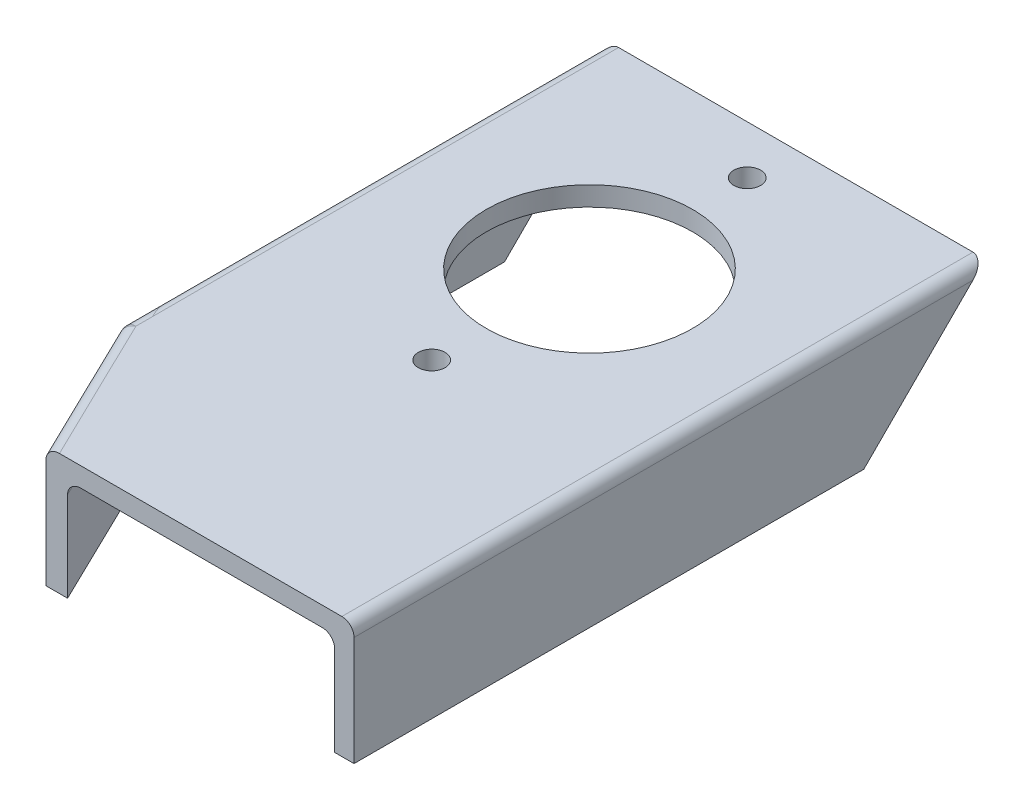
ISO-10303-21;
HEADER;
FILE_DESCRIPTION(('STEP AP214'),'2;1');
FILE_NAME('part.step','',(''),(''),'','','');
FILE_SCHEMA(('AUTOMOTIVE_DESIGN { 1 0 10303 214 1 1 1 1 }'));
ENDSEC;
DATA;
#1=APPLICATION_CONTEXT('core data for automotive mechanical design processes');
#2=APPLICATION_PROTOCOL_DEFINITION('international standard','automotive_design',2000,#1);
#3=PRODUCT_CONTEXT('',#1,'mechanical');
#4=PRODUCT('Part','Part','',(#3));
#5=PRODUCT_RELATED_PRODUCT_CATEGORY('part','',(#4));
#6=PRODUCT_DEFINITION_FORMATION('','',#4);
#7=PRODUCT_DEFINITION_CONTEXT('part definition',#1,'design');
#8=PRODUCT_DEFINITION('design','',#6,#7);
#9=PRODUCT_DEFINITION_SHAPE('','',#8);
#10=(LENGTH_UNIT() NAMED_UNIT(*) SI_UNIT(.MILLI.,.METRE.));
#11=(NAMED_UNIT(*) PLANE_ANGLE_UNIT() SI_UNIT($,.RADIAN.));
#12=(NAMED_UNIT(*) SI_UNIT($,.STERADIAN.) SOLID_ANGLE_UNIT());
#13=UNCERTAINTY_MEASURE_WITH_UNIT(LENGTH_MEASURE(1.E-05),#10,'distance_accuracy_value','');
#14=(GEOMETRIC_REPRESENTATION_CONTEXT(3) GLOBAL_UNCERTAINTY_ASSIGNED_CONTEXT((#13)) GLOBAL_UNIT_ASSIGNED_CONTEXT((#10,
#11,#12)) REPRESENTATION_CONTEXT('',''));
#15=CARTESIAN_POINT('',(0.,0.,0.));
#16=DIRECTION('',(0.,0.,1.));
#17=DIRECTION('',(1.,0.,0.));
#18=AXIS2_PLACEMENT_3D('',#15,#16,#17);
#19=CARTESIAN_POINT('',(-78.,0.,320.));
#20=DIRECTION('',(0.,-1.,0.));
#21=DIRECTION('',(1.,0.,0.));
#22=AXIS2_PLACEMENT_3D('',#19,#20,#21);
#23=PLANE('',#22);
#24=CARTESIAN_POINT('',(0.,0.,20.));
#25=DIRECTION('',(0.,1.,0.));
#26=DIRECTION('',(-1.,0.,0.));
#27=AXIS2_PLACEMENT_3D('',#24,#25,#26);
#28=CIRCLE('',#27,5.5);
#29=CARTESIAN_POINT('',(-5.50000000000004,0.,20.));
#30=VERTEX_POINT('',#29);
#31=EDGE_CURVE('E241',#30,#30,#28,.T.);
#32=ORIENTED_EDGE('',*,*,#31,.F.);
#33=EDGE_LOOP('',(#32));
#34=FACE_BOUND('',#33,.T.);
#35=CARTESIAN_POINT('',(0.,0.,150.));
#36=DIRECTION('',(0.,1.,0.));
#37=DIRECTION('',(-1.,0.,0.));
#38=AXIS2_PLACEMENT_3D('',#35,#36,#37);
#39=CIRCLE('',#38,5.5);
#40=CARTESIAN_POINT('',(-5.50000000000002,0.,150.));
#41=VERTEX_POINT('',#40);
#42=EDGE_CURVE('E247',#41,#41,#39,.T.);
#43=ORIENTED_EDGE('',*,*,#42,.F.);
#44=EDGE_LOOP('',(#43));
#45=FACE_BOUND('',#44,.T.);
#46=CARTESIAN_POINT('',(0.,0.,85.));
#47=DIRECTION('',(0.,1.,0.));
#48=DIRECTION('',(-1.,0.,0.));
#49=AXIS2_PLACEMENT_3D('',#46,#47,#48);
#50=CIRCLE('',#49,42.5);
#51=CARTESIAN_POINT('',(-42.5,0.,85.));
#52=VERTEX_POINT('',#51);
#53=EDGE_CURVE('E253',#52,#52,#50,.T.);
#54=ORIENTED_EDGE('',*,*,#53,.F.);
#55=EDGE_LOOP('',(#54));
#56=FACE_BOUND('',#55,.T.);
#57=DIRECTION('',(0.,0.,-1.));
#58=VECTOR('',#57,1.);
#59=CARTESIAN_POINT('',(-73.,0.,320.));
#60=LINE('',#59,#58);
#61=CARTESIAN_POINT('',(-73.,0.,0.));
#62=VERTEX_POINT('',#61);
#63=CARTESIAN_POINT('',(-73.,0.,191.978082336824));
#64=VERTEX_POINT('',#63);
#65=EDGE_CURVE('E281',#62,#64,#60,.F.);
#66=ORIENTED_EDGE('',*,*,#65,.T.);
#67=DIRECTION('',(0.,0.,1.));
#68=VECTOR('',#67,1.);
#69=CARTESIAN_POINT('',(-73.,0.,320.));
#70=LINE('',#69,#68);
#71=CARTESIAN_POINT('',(-73.,0.,198.851183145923));
#72=VERTEX_POINT('',#71);
#73=EDGE_CURVE('E194',#64,#72,#70,.T.);
#74=ORIENTED_EDGE('',*,*,#73,.T.);
#75=DIRECTION('',(0.436484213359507,0.,0.899711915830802));
#76=VECTOR('',#75,1.);
#77=CARTESIAN_POINT('',(-44.393175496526,0.,257.817578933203));
#78=LINE('',#77,#76);
#79=CARTESIAN_POINT('',(-43.33440065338,0.,260.));
#80=VERTEX_POINT('',#79);
#81=EDGE_CURVE('E301',#72,#80,#78,.T.);
#82=ORIENTED_EDGE('',*,*,#81,.T.);
#83=DIRECTION('',(-1.,0.,0.));
#84=VECTOR('',#83,1.);
#85=CARTESIAN_POINT('',(-28.,0.,260.));
#86=LINE('',#85,#84);
#87=CARTESIAN_POINT('',(73.,0.,260.));
#88=VERTEX_POINT('',#87);
#89=EDGE_CURVE('E217',#88,#80,#86,.T.);
#90=ORIENTED_EDGE('',*,*,#89,.F.);
#91=DIRECTION('',(0.,0.,-1.));
#92=VECTOR('',#91,1.);
#93=CARTESIAN_POINT('',(73.,0.,320.));
#94=LINE('',#93,#92);
#95=CARTESIAN_POINT('',(73.,0.,0.));
#96=VERTEX_POINT('',#95);
#97=EDGE_CURVE('E279',#88,#96,#94,.T.);
#98=ORIENTED_EDGE('',*,*,#97,.T.);
#99=DIRECTION('',(-1.,0.,0.));
#100=VECTOR('',#99,1.);
#101=CARTESIAN_POINT('',(-78.,0.,0.));
#102=LINE('',#101,#100);
#103=EDGE_CURVE('E259',#96,#62,#102,.T.);
#104=ORIENTED_EDGE('',*,*,#103,.T.);
#105=EDGE_LOOP('',(#66,#74,#82,#90,#98,#104));
#106=FACE_BOUND('',#105,.T.);
#107=ADVANCED_FACE('F41',(#34,#45,#56,#106),#23,.F.);
#108=CARTESIAN_POINT('',(-70.,-8.00000000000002,320.));
#109=DIRECTION('',(-1.,0.,0.));
#110=DIRECTION('',(0.,0.,1.));
#111=AXIS2_PLACEMENT_3D('',#108,#109,#110);
#112=PLANE('',#111);
#113=DIRECTION('',(0.,0.,-1.));
#114=VECTOR('',#113,1.);
#115=CARTESIAN_POINT('',(-70.,-13.,320.));
#116=LINE('',#115,#114);
#117=CARTESIAN_POINT('',(-70.,-13.,13.));
#118=VERTEX_POINT('',#117);
#119=CARTESIAN_POINT('',(-70.,-13.,197.013076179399));
#120=VERTEX_POINT('',#119);
#121=EDGE_CURVE('E189',#118,#120,#116,.F.);
#122=ORIENTED_EDGE('',*,*,#121,.T.);
#123=DIRECTION('',(0.,-1.,0.));
#124=VECTOR('',#123,1.);
#125=CARTESIAN_POINT('',(-70.,-7.99999999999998,197.013076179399));
#126=LINE('',#125,#124);
#127=CARTESIAN_POINT('',(-70.,-50.,197.013076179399));
#128=VERTEX_POINT('',#127);
#129=EDGE_CURVE('E292',#120,#128,#126,.T.);
#130=ORIENTED_EDGE('',*,*,#129,.T.);
#131=DIRECTION('',(0.,0.,-1.));
#132=VECTOR('',#131,1.);
#133=CARTESIAN_POINT('',(-70.,-50.,320.));
#134=LINE('',#133,#132);
#135=CARTESIAN_POINT('',(-70.,-50.0000000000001,50.));
#136=VERTEX_POINT('',#135);
#137=EDGE_CURVE('E266',#128,#136,#134,.T.);
#138=ORIENTED_EDGE('',*,*,#137,.T.);
#139=DIRECTION('',(0.,0.707106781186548,-0.707106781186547));
#140=VECTOR('',#139,1.);
#141=CARTESIAN_POINT('',(-70.,-164.,164.));
#142=LINE('',#141,#140);
#143=EDGE_CURVE('E238',#136,#118,#142,.T.);
#144=ORIENTED_EDGE('',*,*,#143,.T.);
#145=EDGE_LOOP('',(#122,#130,#138,#144));
#146=FACE_BOUND('',#145,.T.);
#147=ADVANCED_FACE('F371',(#146),#112,.F.);
#148=CARTESIAN_POINT('',(70.,-8.,320.));
#149=DIRECTION('',(0.,1.,0.));
#150=DIRECTION('',(-1.,0.,0.));
#151=AXIS2_PLACEMENT_3D('',#148,#149,#150);
#152=PLANE('',#151);
#153=CARTESIAN_POINT('',(0.,-8.00000000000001,85.));
#154=DIRECTION('',(0.,1.,0.));
#155=DIRECTION('',(-1.,0.,0.));
#156=AXIS2_PLACEMENT_3D('',#153,#154,#155);
#157=CIRCLE('',#156,42.5);
#158=CARTESIAN_POINT('',(-42.5,-8.00000000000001,85.));
#159=VERTEX_POINT('',#158);
#160=EDGE_CURVE('E256',#159,#159,#157,.T.);
#161=ORIENTED_EDGE('',*,*,#160,.T.);
#162=EDGE_LOOP('',(#161));
#163=FACE_BOUND('',#162,.T.);
#164=CARTESIAN_POINT('',(0.,-8.00000000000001,150.));
#165=DIRECTION('',(0.,1.,0.));
#166=DIRECTION('',(-1.,0.,0.));
#167=AXIS2_PLACEMENT_3D('',#164,#165,#166);
#168=CIRCLE('',#167,5.5);
#169=CARTESIAN_POINT('',(-5.50000000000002,-8.00000000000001,150.));
#170=VERTEX_POINT('',#169);
#171=EDGE_CURVE('E250',#170,#170,#168,.T.);
#172=ORIENTED_EDGE('',*,*,#171,.T.);
#173=EDGE_LOOP('',(#172));
#174=FACE_BOUND('',#173,.T.);
#175=CARTESIAN_POINT('',(0.,-8.00000000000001,20.));
#176=DIRECTION('',(0.,1.,0.));
#177=DIRECTION('',(-1.,0.,0.));
#178=AXIS2_PLACEMENT_3D('',#175,#176,#177);
#179=CIRCLE('',#178,5.5);
#180=CARTESIAN_POINT('',(-5.50000000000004,-8.00000000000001,20.));
#181=VERTEX_POINT('',#180);
#182=EDGE_CURVE('E244',#181,#181,#179,.T.);
#183=ORIENTED_EDGE('',*,*,#182,.T.);
#184=EDGE_LOOP('',(#183));
#185=FACE_BOUND('',#184,.T.);
#186=DIRECTION('',(-1.,0.,0.));
#187=VECTOR('',#186,1.);
#188=CARTESIAN_POINT('',(70.,-8.,260.));
#189=LINE('',#188,#187);
#190=CARTESIAN_POINT('',(65.,-8.,260.));
#191=VERTEX_POINT('',#190);
#192=CARTESIAN_POINT('',(-34.4426655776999,-8.00000000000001,260.));
#193=VERTEX_POINT('',#192);
#194=EDGE_CURVE('E220',#191,#193,#189,.T.);
#195=ORIENTED_EDGE('',*,*,#194,.T.);
#196=DIRECTION('',(-0.436484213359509,0.,-0.899711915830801));
#197=VECTOR('',#196,1.);
#198=CARTESIAN_POINT('',(9.0181939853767,-8.00000000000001,349.584576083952));
#199=LINE('',#198,#197);
#200=CARTESIAN_POINT('',(-65.,-8.00000000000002,197.013076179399));
#201=VERTEX_POINT('',#200);
#202=EDGE_CURVE('E179',#193,#201,#199,.T.);
#203=ORIENTED_EDGE('',*,*,#202,.T.);
#204=DIRECTION('',(0.,0.,-1.));
#205=VECTOR('',#204,1.);
#206=CARTESIAN_POINT('',(-65.,-8.00000000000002,8.00000000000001));
#207=LINE('',#206,#205);
#208=CARTESIAN_POINT('',(-65.,-8.00000000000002,7.99999999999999));
#209=VERTEX_POINT('',#208);
#210=EDGE_CURVE('E273',#201,#209,#207,.T.);
#211=ORIENTED_EDGE('',*,*,#210,.T.);
#212=DIRECTION('',(1.,0.,0.));
#213=VECTOR('',#212,1.);
#214=CARTESIAN_POINT('',(70.0000000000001,-8.,8.00000000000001));
#215=LINE('',#214,#213);
#216=CARTESIAN_POINT('',(65.,-8.,8.00000000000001));
#217=VERTEX_POINT('',#216);
#218=EDGE_CURVE('E235',#209,#217,#215,.T.);
#219=ORIENTED_EDGE('',*,*,#218,.T.);
#220=DIRECTION('',(0.,0.,-1.));
#221=VECTOR('',#220,1.);
#222=CARTESIAN_POINT('',(65.,-8.,320.));
#223=LINE('',#222,#221);
#224=EDGE_CURVE('E270',#217,#191,#223,.F.);
#225=ORIENTED_EDGE('',*,*,#224,.T.);
#226=EDGE_LOOP('',(#195,#203,#211,#219,#225));
#227=FACE_BOUND('',#226,.T.);
#228=ADVANCED_FACE('F378',(#163,#174,#185,#227),#152,.F.);
#229=CARTESIAN_POINT('',(-65.,-13.,320.));
#230=DIRECTION('',(0.,0.,1.));
#231=DIRECTION('',(1.,0.,0.));
#232=AXIS2_PLACEMENT_3D('',#229,#230,#231);
#233=CYLINDRICAL_SURFACE('',#232,5.);
#234=ORIENTED_EDGE('',*,*,#210,.F.);
#235=CARTESIAN_POINT('',(-65.,-13.,197.013076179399));
#236=DIRECTION('',(0.,0.,1.));
#237=DIRECTION('',(1.,0.,0.));
#238=AXIS2_PLACEMENT_3D('',#235,#236,#237);
#239=CIRCLE('',#238,5.);
#240=EDGE_CURVE('E299',#201,#120,#239,.T.);
#241=ORIENTED_EDGE('',*,*,#240,.T.);
#242=ORIENTED_EDGE('',*,*,#121,.F.);
#243=CARTESIAN_POINT('',(-65.,-13.,13.));
#244=DIRECTION('',(0.,0.707106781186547,0.707106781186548));
#245=DIRECTION('',(0.,-0.707106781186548,0.707106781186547));
#246=AXIS2_PLACEMENT_3D('',#243,#244,#245);
#247=ELLIPSE('',#246,7.07106781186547,5.);
#248=EDGE_CURVE('E288',#209,#118,#247,.T.);
#249=ORIENTED_EDGE('',*,*,#248,.F.);
#250=EDGE_LOOP('',(#234,#241,#242,#249));
#251=FACE_BOUND('',#250,.T.);
#252=ADVANCED_FACE('F400',(#251),#233,.F.);
#253=CARTESIAN_POINT('',(-73.,-5.,320.));
#254=DIRECTION('',(0.,0.,-1.));
#255=DIRECTION('',(-1.,0.,0.));
#256=AXIS2_PLACEMENT_3D('',#253,#254,#255);
#257=CYLINDRICAL_SURFACE('',#256,5.);
#258=CARTESIAN_POINT('',(-73.,-5.,191.978082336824));
#259=DIRECTION('',(0.899711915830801,0.,-0.436484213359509));
#260=DIRECTION('',(-0.436484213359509,0.,-0.899711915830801));
#261=AXIS2_PLACEMENT_3D('',#258,#259,#260);
#262=ELLIPSE('',#261,11.4551680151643,5.);
#263=CARTESIAN_POINT('',(-78.,-5.,181.671731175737));
#264=VERTEX_POINT('',#263);
#265=EDGE_CURVE('E184',#64,#264,#262,.F.);
#266=ORIENTED_EDGE('',*,*,#265,.F.);
#267=ORIENTED_EDGE('',*,*,#65,.F.);
#268=CARTESIAN_POINT('',(-73.,-5.,4.99999999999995));
#269=DIRECTION('',(0.,0.707106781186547,0.707106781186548));
#270=DIRECTION('',(0.,0.707106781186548,-0.707106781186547));
#271=AXIS2_PLACEMENT_3D('',#268,#269,#270);
#272=ELLIPSE('',#271,7.07106781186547,5.);
#273=CARTESIAN_POINT('',(-78.,-5.,4.99999999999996));
#274=VERTEX_POINT('',#273);
#275=EDGE_CURVE('E186',#274,#62,#272,.F.);
#276=ORIENTED_EDGE('',*,*,#275,.F.);
#277=DIRECTION('',(0.,0.,-1.));
#278=VECTOR('',#277,1.);
#279=CARTESIAN_POINT('',(-78.,-5.,320.));
#280=LINE('',#279,#278);
#281=EDGE_CURVE('E170',#264,#274,#280,.T.);
#282=ORIENTED_EDGE('',*,*,#281,.F.);
#283=EDGE_LOOP('',(#266,#267,#276,#282));
#284=FACE_BOUND('',#283,.T.);
#285=ADVANCED_FACE('F182',(#284),#257,.T.);
#286=CARTESIAN_POINT('',(-78.,-50.,320.));
#287=DIRECTION('',(1.,0.,0.));
#288=DIRECTION('',(0.,1.,0.));
#289=AXIS2_PLACEMENT_3D('',#286,#287,#288);
#290=PLANE('',#289);
#291=DIRECTION('',(0.,-1.,0.));
#292=VECTOR('',#291,1.);
#293=CARTESIAN_POINT('',(-78.,0.,198.851183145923));
#294=LINE('',#293,#292);
#295=CARTESIAN_POINT('',(-78.,-50.,198.851183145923));
#296=VERTEX_POINT('',#295);
#297=CARTESIAN_POINT('',(-78.,-5.,198.851183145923));
#298=VERTEX_POINT('',#297);
#299=EDGE_CURVE('E174',#296,#298,#294,.F.);
#300=ORIENTED_EDGE('',*,*,#299,.T.);
#301=DIRECTION('',(0.,0.,1.));
#302=VECTOR('',#301,1.);
#303=CARTESIAN_POINT('',(-78.,-5.,320.));
#304=LINE('',#303,#302);
#305=EDGE_CURVE('E166',#298,#264,#304,.F.);
#306=ORIENTED_EDGE('',*,*,#305,.T.);
#307=ORIENTED_EDGE('',*,*,#281,.T.);
#308=DIRECTION('',(0.,-0.707106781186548,0.707106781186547));
#309=VECTOR('',#308,1.);
#310=CARTESIAN_POINT('',(-78.,0.,0.));
#311=LINE('',#310,#309);
#312=CARTESIAN_POINT('',(-78.,-50.0000000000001,50.));
#313=VERTEX_POINT('',#312);
#314=EDGE_CURVE('E226',#274,#313,#311,.T.);
#315=ORIENTED_EDGE('',*,*,#314,.T.);
#316=DIRECTION('',(0.,0.,-1.));
#317=VECTOR('',#316,1.);
#318=CARTESIAN_POINT('',(-78.,-50.,320.));
#319=LINE('',#318,#317);
#320=EDGE_CURVE('E268',#296,#313,#319,.T.);
#321=ORIENTED_EDGE('',*,*,#320,.F.);
#322=EDGE_LOOP('',(#300,#306,#307,#315,#321));
#323=FACE_BOUND('',#322,.T.);
#324=ADVANCED_FACE('F168',(#323),#290,.F.);
#325=CARTESIAN_POINT('',(-70.,-50.,320.));
#326=DIRECTION('',(0.,1.,0.));
#327=DIRECTION('',(0.,0.,1.));
#328=AXIS2_PLACEMENT_3D('',#325,#326,#327);
#329=PLANE('',#328);
#330=DIRECTION('',(-0.436484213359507,0.,-0.899711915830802));
#331=VECTOR('',#330,1.);
#332=CARTESIAN_POINT('',(-78.,-50.,200.));
#333=LINE('',#332,#331);
#334=CARTESIAN_POINT('',(-48.89173507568,-50.,260.));
#335=VERTEX_POINT('',#334);
#336=CARTESIAN_POINT('',(-77.498559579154,-50.,201.03360421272));
#337=VERTEX_POINT('',#336);
#338=EDGE_CURVE('E345',#335,#337,#333,.T.);
#339=ORIENTED_EDGE('',*,*,#338,.T.);
#340=CARTESIAN_POINT('',(-73.,-50.,198.851183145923));
#341=DIRECTION('',(0.,1.,0.));
#342=DIRECTION('',(0.,0.,1.));
#343=AXIS2_PLACEMENT_3D('',#340,#341,#342);
#344=CIRCLE('',#343,5.);
#345=EDGE_CURVE('E308',#337,#296,#344,.F.);
#346=ORIENTED_EDGE('',*,*,#345,.T.);
#347=ORIENTED_EDGE('',*,*,#320,.T.);
#348=DIRECTION('',(1.,0.,0.));
#349=VECTOR('',#348,1.);
#350=CARTESIAN_POINT('',(-78.,-50.0000000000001,50.));
#351=LINE('',#350,#349);
#352=EDGE_CURVE('E229',#313,#136,#351,.T.);
#353=ORIENTED_EDGE('',*,*,#352,.T.);
#354=ORIENTED_EDGE('',*,*,#137,.F.);
#355=CARTESIAN_POINT('',(-65.,-50.,197.013076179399));
#356=DIRECTION('',(0.,1.,0.));
#357=DIRECTION('',(0.,0.,1.));
#358=AXIS2_PLACEMENT_3D('',#355,#356,#357);
#359=CIRCLE('',#358,5.);
#360=CARTESIAN_POINT('',(-69.498559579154,-50.,199.195497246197));
#361=VERTEX_POINT('',#360);
#362=EDGE_CURVE('E50',#128,#361,#359,.T.);
#363=ORIENTED_EDGE('',*,*,#362,.T.);
#364=DIRECTION('',(0.436484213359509,0.,0.899711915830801));
#365=VECTOR('',#364,1.);
#366=CARTESIAN_POINT('',(-39.9999999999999,-50.,260.));
#367=LINE('',#366,#365);
#368=CARTESIAN_POINT('',(-39.9999999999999,-50.,260.));
#369=VERTEX_POINT('',#368);
#370=EDGE_CURVE('E347',#361,#369,#367,.T.);
#371=ORIENTED_EDGE('',*,*,#370,.T.);
#372=DIRECTION('',(-1.,0.,0.));
#373=VECTOR('',#372,1.);
#374=CARTESIAN_POINT('',(-48.89173507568,-50.,260.));
#375=LINE('',#374,#373);
#376=EDGE_CURVE('E319',#369,#335,#375,.T.);
#377=ORIENTED_EDGE('',*,*,#376,.T.);
#378=EDGE_LOOP('',(#339,#346,#347,#353,#354,#363,#371,#377));
#379=FACE_BOUND('',#378,.T.);
#380=ADVANCED_FACE('F343',(#379),#329,.F.);
#381=CARTESIAN_POINT('',(70.,-50.,320.));
#382=DIRECTION('',(1.,0.,0.));
#383=DIRECTION('',(0.,1.,0.));
#384=AXIS2_PLACEMENT_3D('',#381,#382,#383);
#385=PLANE('',#384);
#386=DIRECTION('',(0.,0.,-1.));
#387=VECTOR('',#386,1.);
#388=CARTESIAN_POINT('',(70.,-50.,320.));
#389=LINE('',#388,#387);
#390=CARTESIAN_POINT('',(70.,-50.0000000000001,260.));
#391=VERTEX_POINT('',#390);
#392=CARTESIAN_POINT('',(70.,-50.,50.));
#393=VERTEX_POINT('',#392);
#394=EDGE_CURVE('E264',#391,#393,#389,.T.);
#395=ORIENTED_EDGE('',*,*,#394,.F.);
#396=DIRECTION('',(0.,1.,0.));
#397=VECTOR('',#396,1.);
#398=CARTESIAN_POINT('',(70.,-50.,260.));
#399=LINE('',#398,#397);
#400=CARTESIAN_POINT('',(70.,-13.,260.));
#401=VERTEX_POINT('',#400);
#402=EDGE_CURVE('E214',#391,#401,#399,.T.);
#403=ORIENTED_EDGE('',*,*,#402,.T.);
#404=DIRECTION('',(0.,0.,-1.));
#405=VECTOR('',#404,1.);
#406=CARTESIAN_POINT('',(70.,-13.,8.00000000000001));
#407=LINE('',#406,#405);
#408=CARTESIAN_POINT('',(70.,-13.,13.));
#409=VERTEX_POINT('',#408);
#410=EDGE_CURVE('E283',#401,#409,#407,.T.);
#411=ORIENTED_EDGE('',*,*,#410,.T.);
#412=DIRECTION('',(0.,-0.707106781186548,0.707106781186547));
#413=VECTOR('',#412,1.);
#414=CARTESIAN_POINT('',(70.0000000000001,-185.,185.));
#415=LINE('',#414,#413);
#416=EDGE_CURVE('E232',#409,#393,#415,.T.);
#417=ORIENTED_EDGE('',*,*,#416,.T.);
#418=EDGE_LOOP('',(#395,#403,#411,#417));
#419=FACE_BOUND('',#418,.T.);
#420=ADVANCED_FACE('F394',(#419),#385,.F.);
#421=CARTESIAN_POINT('',(78.,-50.,320.));
#422=DIRECTION('',(0.,1.,0.));
#423=DIRECTION('',(0.,0.,1.));
#424=AXIS2_PLACEMENT_3D('',#421,#422,#423);
#425=PLANE('',#424);
#426=DIRECTION('',(0.,0.,-1.));
#427=VECTOR('',#426,1.);
#428=CARTESIAN_POINT('',(78.,-50.,320.));
#429=LINE('',#428,#427);
#430=CARTESIAN_POINT('',(78.,-50.0000000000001,260.));
#431=VERTEX_POINT('',#430);
#432=CARTESIAN_POINT('',(78.,-50.,50.));
#433=VERTEX_POINT('',#432);
#434=EDGE_CURVE('E262',#431,#433,#429,.T.);
#435=ORIENTED_EDGE('',*,*,#434,.F.);
#436=DIRECTION('',(-1.,0.,0.));
#437=VECTOR('',#436,1.);
#438=CARTESIAN_POINT('',(133.752808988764,-50.0000000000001,260.));
#439=LINE('',#438,#437);
#440=EDGE_CURVE('E195',#431,#391,#439,.T.);
#441=ORIENTED_EDGE('',*,*,#440,.T.);
#442=ORIENTED_EDGE('',*,*,#394,.T.);
#443=EDGE_CURVE('E228',#393,#433,#351,.T.);
#444=ORIENTED_EDGE('',*,*,#443,.T.);
#445=EDGE_LOOP('',(#435,#441,#442,#444));
#446=FACE_BOUND('',#445,.T.);
#447=ADVANCED_FACE('F390',(#446),#425,.F.);
#448=CARTESIAN_POINT('',(78.,0.,320.));
#449=DIRECTION('',(-1.,0.,0.));
#450=DIRECTION('',(0.,-1.,0.));
#451=AXIS2_PLACEMENT_3D('',#448,#449,#450);
#452=PLANE('',#451);
#453=DIRECTION('',(0.,0.,-1.));
#454=VECTOR('',#453,1.);
#455=CARTESIAN_POINT('',(78.,-5.,320.));
#456=LINE('',#455,#454);
#457=CARTESIAN_POINT('',(78.,-5.,5.));
#458=VERTEX_POINT('',#457);
#459=CARTESIAN_POINT('',(78.,-5.,260.));
#460=VERTEX_POINT('',#459);
#461=EDGE_CURVE('E285',#458,#460,#456,.F.);
#462=ORIENTED_EDGE('',*,*,#461,.T.);
#463=DIRECTION('',(0.,-1.,0.));
#464=VECTOR('',#463,1.);
#465=CARTESIAN_POINT('',(78.,0.,260.));
#466=LINE('',#465,#464);
#467=EDGE_CURVE('E208',#460,#431,#466,.T.);
#468=ORIENTED_EDGE('',*,*,#467,.T.);
#469=ORIENTED_EDGE('',*,*,#434,.T.);
#470=DIRECTION('',(0.,-0.707106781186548,0.707106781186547));
#471=VECTOR('',#470,1.);
#472=CARTESIAN_POINT('',(78.,0.,0.));
#473=LINE('',#472,#471);
#474=EDGE_CURVE('E223',#458,#433,#473,.T.);
#475=ORIENTED_EDGE('',*,*,#474,.F.);
#476=EDGE_LOOP('',(#462,#468,#469,#475));
#477=FACE_BOUND('',#476,.T.);
#478=ADVANCED_FACE('F387',(#477),#452,.F.);
#479=CARTESIAN_POINT('',(0.,-320.,85.));
#480=DIRECTION('',(0.,1.,0.));
#481=DIRECTION('',(-1.,0.,0.));
#482=AXIS2_PLACEMENT_3D('',#479,#480,#481);
#483=CYLINDRICAL_SURFACE('',#482,42.5);
#484=ORIENTED_EDGE('',*,*,#53,.T.);
#485=EDGE_LOOP('',(#484));
#486=FACE_BOUND('',#485,.T.);
#487=ORIENTED_EDGE('',*,*,#160,.F.);
#488=EDGE_LOOP('',(#487));
#489=FACE_BOUND('',#488,.T.);
#490=ADVANCED_FACE('F385',(#486,#489),#483,.F.);
#491=CARTESIAN_POINT('',(0.,-320.,150.));
#492=DIRECTION('',(0.,1.,0.));
#493=DIRECTION('',(-1.,0.,0.));
#494=AXIS2_PLACEMENT_3D('',#491,#492,#493);
#495=CYLINDRICAL_SURFACE('',#494,5.5);
#496=ORIENTED_EDGE('',*,*,#42,.T.);
#497=EDGE_LOOP('',(#496));
#498=FACE_BOUND('',#497,.T.);
#499=ORIENTED_EDGE('',*,*,#171,.F.);
#500=EDGE_LOOP('',(#499));
#501=FACE_BOUND('',#500,.T.);
#502=ADVANCED_FACE('F506',(#498,#501),#495,.F.);
#503=CARTESIAN_POINT('',(0.,-320.,20.));
#504=DIRECTION('',(0.,1.,0.));
#505=DIRECTION('',(-1.,0.,0.));
#506=AXIS2_PLACEMENT_3D('',#503,#504,#505);
#507=CYLINDRICAL_SURFACE('',#506,5.5);
#508=ORIENTED_EDGE('',*,*,#31,.T.);
#509=EDGE_LOOP('',(#508));
#510=FACE_BOUND('',#509,.T.);
#511=ORIENTED_EDGE('',*,*,#182,.F.);
#512=EDGE_LOOP('',(#511));
#513=FACE_BOUND('',#512,.T.);
#514=ADVANCED_FACE('F504',(#510,#513),#507,.F.);
#515=CARTESIAN_POINT('',(-78.,0.,0.));
#516=DIRECTION('',(0.,0.707106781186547,0.707106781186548));
#517=DIRECTION('',(0.,-0.707106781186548,0.707106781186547));
#518=AXIS2_PLACEMENT_3D('',#515,#516,#517);
#519=PLANE('',#518);
#520=ORIENTED_EDGE('',*,*,#314,.F.);
#521=ORIENTED_EDGE('',*,*,#275,.T.);
#522=ORIENTED_EDGE('',*,*,#103,.F.);
#523=CARTESIAN_POINT('',(73.,-5.,4.99999999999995));
#524=DIRECTION('',(0.,0.707106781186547,0.707106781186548));
#525=DIRECTION('',(0.,0.707106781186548,-0.707106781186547));
#526=AXIS2_PLACEMENT_3D('',#523,#524,#525);
#527=ELLIPSE('',#526,7.07106781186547,5.);
#528=EDGE_CURVE('E188',#96,#458,#527,.F.);
#529=ORIENTED_EDGE('',*,*,#528,.T.);
#530=ORIENTED_EDGE('',*,*,#474,.T.);
#531=ORIENTED_EDGE('',*,*,#443,.F.);
#532=ORIENTED_EDGE('',*,*,#416,.F.);
#533=CARTESIAN_POINT('',(65.,-13.,13.));
#534=DIRECTION('',(0.,0.707106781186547,0.707106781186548));
#535=DIRECTION('',(0.,-0.707106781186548,0.707106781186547));
#536=AXIS2_PLACEMENT_3D('',#533,#534,#535);
#537=ELLIPSE('',#536,7.07106781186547,5.);
#538=EDGE_CURVE('E290',#409,#217,#537,.T.);
#539=ORIENTED_EDGE('',*,*,#538,.T.);
#540=ORIENTED_EDGE('',*,*,#218,.F.);
#541=ORIENTED_EDGE('',*,*,#248,.T.);
#542=ORIENTED_EDGE('',*,*,#143,.F.);
#543=ORIENTED_EDGE('',*,*,#352,.F.);
#544=EDGE_LOOP('',(#520,#521,#522,#529,#530,#531,#532,#539,#540,#541,#542,#543));
#545=FACE_BOUND('',#544,.T.);
#546=ADVANCED_FACE('F335',(#545),#519,.F.);
#547=CARTESIAN_POINT('',(65.,-13.,320.));
#548=DIRECTION('',(0.,0.,1.));
#549=DIRECTION('',(1.,0.,0.));
#550=AXIS2_PLACEMENT_3D('',#547,#548,#549);
#551=CYLINDRICAL_SURFACE('',#550,5.);
#552=ORIENTED_EDGE('',*,*,#410,.F.);
#553=CARTESIAN_POINT('',(65.,-13.,260.));
#554=DIRECTION('',(0.,0.,-1.));
#555=DIRECTION('',(-1.,0.,0.));
#556=AXIS2_PLACEMENT_3D('',#553,#554,#555);
#557=CIRCLE('',#556,5.);
#558=EDGE_CURVE('E211',#401,#191,#557,.F.);
#559=ORIENTED_EDGE('',*,*,#558,.T.);
#560=ORIENTED_EDGE('',*,*,#224,.F.);
#561=ORIENTED_EDGE('',*,*,#538,.F.);
#562=EDGE_LOOP('',(#552,#559,#560,#561));
#563=FACE_BOUND('',#562,.T.);
#564=ADVANCED_FACE('F499',(#563),#551,.F.);
#565=CARTESIAN_POINT('',(73.,-5.,320.));
#566=DIRECTION('',(0.,0.,-1.));
#567=DIRECTION('',(-1.,0.,0.));
#568=AXIS2_PLACEMENT_3D('',#565,#566,#567);
#569=CYLINDRICAL_SURFACE('',#568,5.);
#570=CARTESIAN_POINT('',(73.,-5.,260.));
#571=DIRECTION('',(0.,0.,-1.));
#572=DIRECTION('',(-1.,0.,0.));
#573=AXIS2_PLACEMENT_3D('',#570,#571,#572);
#574=CIRCLE('',#573,5.);
#575=EDGE_CURVE('E199',#460,#88,#574,.F.);
#576=ORIENTED_EDGE('',*,*,#575,.F.);
#577=ORIENTED_EDGE('',*,*,#461,.F.);
#578=ORIENTED_EDGE('',*,*,#528,.F.);
#579=ORIENTED_EDGE('',*,*,#97,.F.);
#580=EDGE_LOOP('',(#576,#577,#578,#579));
#581=FACE_BOUND('',#580,.T.);
#582=ADVANCED_FACE('F458',(#581),#569,.T.);
#583=CARTESIAN_POINT('',(-28.,-10.,260.));
#584=DIRECTION('',(0.,0.,-1.));
#585=DIRECTION('',(-1.,0.,0.));
#586=AXIS2_PLACEMENT_3D('',#583,#584,#585);
#587=PLANE('',#586);
#588=ORIENTED_EDGE('',*,*,#89,.T.);
#589=CARTESIAN_POINT('',(-43.33440065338,-5.,260.));
#590=DIRECTION('',(0.,0.,-1.));
#591=DIRECTION('',(-1.,0.,0.));
#592=AXIS2_PLACEMENT_3D('',#589,#590,#591);
#593=ELLIPSE('',#592,5.5573344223,5.);
#594=CARTESIAN_POINT('',(-48.89173507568,-5.,260.));
#595=VERTEX_POINT('',#594);
#596=EDGE_CURVE('E310',#80,#595,#593,.F.);
#597=ORIENTED_EDGE('',*,*,#596,.T.);
#598=DIRECTION('',(0.,-1.,0.));
#599=VECTOR('',#598,1.);
#600=CARTESIAN_POINT('',(-48.89173507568,87.0592769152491,260.));
#601=LINE('',#600,#599);
#602=EDGE_CURVE('E202',#595,#335,#601,.T.);
#603=ORIENTED_EDGE('',*,*,#602,.T.);
#604=ORIENTED_EDGE('',*,*,#376,.F.);
#605=DIRECTION('',(0.,-1.,0.));
#606=VECTOR('',#605,1.);
#607=CARTESIAN_POINT('',(-39.9999999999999,87.0592769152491,260.));
#608=LINE('',#607,#606);
#609=CARTESIAN_POINT('',(-39.9999999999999,-13.,260.));
#610=VERTEX_POINT('',#609);
#611=EDGE_CURVE('E196',#610,#369,#608,.T.);
#612=ORIENTED_EDGE('',*,*,#611,.F.);
#613=CARTESIAN_POINT('',(-34.4426655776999,-13.,260.));
#614=DIRECTION('',(0.,0.,-1.));
#615=DIRECTION('',(-1.,0.,0.));
#616=AXIS2_PLACEMENT_3D('',#613,#614,#615);
#617=ELLIPSE('',#616,5.55733442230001,5.);
#618=EDGE_CURVE('E11',#610,#193,#617,.T.);
#619=ORIENTED_EDGE('',*,*,#618,.T.);
#620=ORIENTED_EDGE('',*,*,#194,.F.);
#621=ORIENTED_EDGE('',*,*,#558,.F.);
#622=ORIENTED_EDGE('',*,*,#402,.F.);
#623=ORIENTED_EDGE('',*,*,#440,.F.);
#624=ORIENTED_EDGE('',*,*,#467,.F.);
#625=ORIENTED_EDGE('',*,*,#575,.T.);
#626=EDGE_LOOP('',(#588,#597,#603,#604,#612,#619,#620,#621,#622,#623,#624,#625));
#627=FACE_BOUND('',#626,.T.);
#628=ADVANCED_FACE('F353',(#627),#587,.F.);
#629=CARTESIAN_POINT('',(-39.9999999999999,87.0592769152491,260.));
#630=DIRECTION('',(0.899711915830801,0.,-0.436484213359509));
#631=DIRECTION('',(-0.436484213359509,0.,-0.899711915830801));
#632=AXIS2_PLACEMENT_3D('',#629,#630,#631);
#633=PLANE('',#632);
#634=ORIENTED_EDGE('',*,*,#370,.F.);
#635=DIRECTION('',(0.,-1.,0.));
#636=VECTOR('',#635,1.);
#637=CARTESIAN_POINT('',(-69.498559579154,87.0592769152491,199.195497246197));
#638=LINE('',#637,#636);
#639=CARTESIAN_POINT('',(-69.498559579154,-13.,199.195497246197));
#640=VERTEX_POINT('',#639);
#641=EDGE_CURVE('E297',#361,#640,#638,.F.);
#642=ORIENTED_EDGE('',*,*,#641,.T.);
#643=DIRECTION('',(-0.436484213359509,0.,-0.899711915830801));
#644=VECTOR('',#643,1.);
#645=CARTESIAN_POINT('',(-39.9999999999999,-13.,260.));
#646=LINE('',#645,#644);
#647=EDGE_CURVE('E295',#640,#610,#646,.F.);
#648=ORIENTED_EDGE('',*,*,#647,.T.);
#649=ORIENTED_EDGE('',*,*,#611,.T.);
#650=EDGE_LOOP('',(#634,#642,#648,#649));
#651=FACE_BOUND('',#650,.T.);
#652=ADVANCED_FACE('F358',(#651),#633,.T.);
#653=CARTESIAN_POINT('',(-78.,87.0592769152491,200.));
#654=DIRECTION('',(-0.899711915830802,0.,0.436484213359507));
#655=DIRECTION('',(0.436484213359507,0.,0.899711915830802));
#656=AXIS2_PLACEMENT_3D('',#653,#654,#655);
#657=PLANE('',#656);
#658=DIRECTION('',(0.436484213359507,0.,0.899711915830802));
#659=VECTOR('',#658,1.);
#660=CARTESIAN_POINT('',(-78.,-5.,200.));
#661=LINE('',#660,#659);
#662=CARTESIAN_POINT('',(-77.498559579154,-5.,201.03360421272));
#663=VERTEX_POINT('',#662);
#664=EDGE_CURVE('E58',#595,#663,#661,.F.);
#665=ORIENTED_EDGE('',*,*,#664,.T.);
#666=DIRECTION('',(0.,-1.,0.));
#667=VECTOR('',#666,1.);
#668=CARTESIAN_POINT('',(-77.498559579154,-50.,201.03360421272));
#669=LINE('',#668,#667);
#670=EDGE_CURVE('E62',#663,#337,#669,.T.);
#671=ORIENTED_EDGE('',*,*,#670,.T.);
#672=ORIENTED_EDGE('',*,*,#338,.F.);
#673=ORIENTED_EDGE('',*,*,#602,.F.);
#674=EDGE_LOOP('',(#665,#671,#672,#673));
#675=FACE_BOUND('',#674,.T.);
#676=ADVANCED_FACE('F355',(#675),#657,.T.);
#677=CARTESIAN_POINT('',(9.01819398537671,-13.,349.584576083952));
#678=DIRECTION('',(-0.436484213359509,0.,-0.899711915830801));
#679=DIRECTION('',(-0.899711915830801,0.,0.436484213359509));
#680=AXIS2_PLACEMENT_3D('',#677,#678,#679);
#681=CYLINDRICAL_SURFACE('',#680,5.);
#682=CARTESIAN_POINT('',(-65.,-13.,197.013076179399));
#683=DIRECTION('',(0.436484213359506,0.,0.899711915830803));
#684=DIRECTION('',(0.899711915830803,0.,-0.436484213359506));
#685=AXIS2_PLACEMENT_3D('',#682,#683,#684);
#686=CIRCLE('',#685,5.);
#687=EDGE_CURVE('E316',#201,#640,#686,.T.);
#688=ORIENTED_EDGE('',*,*,#687,.F.);
#689=ORIENTED_EDGE('',*,*,#202,.F.);
#690=ORIENTED_EDGE('',*,*,#618,.F.);
#691=ORIENTED_EDGE('',*,*,#647,.F.);
#692=EDGE_LOOP('',(#688,#689,#690,#691));
#693=FACE_BOUND('',#692,.T.);
#694=ADVANCED_FACE('F357',(#693),#681,.F.);
#695=CARTESIAN_POINT('',(-65.,-13.,197.013076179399));
#696=DIRECTION('',(0.,0.,1.));
#697=DIRECTION('',(1.,0.,0.));
#698=AXIS2_PLACEMENT_3D('',#695,#696,#697);
#699=SPHERICAL_SURFACE('',#698,5.);
#700=ORIENTED_EDGE('',*,*,#240,.F.);
#701=ORIENTED_EDGE('',*,*,#687,.T.);
#702=CARTESIAN_POINT('',(-65.,-13.,197.013076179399));
#703=DIRECTION('',(0.,1.,0.));
#704=DIRECTION('',(0.,0.,1.));
#705=AXIS2_PLACEMENT_3D('',#702,#703,#704);
#706=CIRCLE('',#705,5.);
#707=EDGE_CURVE('E313',#120,#640,#706,.T.);
#708=ORIENTED_EDGE('',*,*,#707,.F.);
#709=EDGE_LOOP('',(#700,#701,#708));
#710=FACE_BOUND('',#709,.T.);
#711=ADVANCED_FACE('F364',(#710),#699,.F.);
#712=CARTESIAN_POINT('',(-65.,-7.99999999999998,197.013076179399));
#713=DIRECTION('',(0.,-1.,0.));
#714=DIRECTION('',(0.,0.,-1.));
#715=AXIS2_PLACEMENT_3D('',#712,#713,#714);
#716=CYLINDRICAL_SURFACE('',#715,5.);
#717=ORIENTED_EDGE('',*,*,#707,.T.);
#718=ORIENTED_EDGE('',*,*,#641,.F.);
#719=ORIENTED_EDGE('',*,*,#362,.F.);
#720=ORIENTED_EDGE('',*,*,#129,.F.);
#721=EDGE_LOOP('',(#717,#718,#719,#720));
#722=FACE_BOUND('',#721,.T.);
#723=ADVANCED_FACE('F407',(#722),#716,.F.);
#724=CARTESIAN_POINT('',(-26.376234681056,-5.,294.955362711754));
#725=DIRECTION('',(-0.436484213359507,0.,-0.899711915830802));
#726=DIRECTION('',(-0.899711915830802,0.,0.436484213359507));
#727=AXIS2_PLACEMENT_3D('',#724,#725,#726);
#728=CYLINDRICAL_SURFACE('',#727,5.);
#729=ORIENTED_EDGE('',*,*,#596,.F.);
#730=ORIENTED_EDGE('',*,*,#81,.F.);
#731=CARTESIAN_POINT('',(-73.,-5.,198.851183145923));
#732=DIRECTION('',(-0.436484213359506,0.,-0.899711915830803));
#733=DIRECTION('',(-0.899711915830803,0.,0.436484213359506));
#734=AXIS2_PLACEMENT_3D('',#731,#732,#733);
#735=CIRCLE('',#734,5.);
#736=EDGE_CURVE('E45',#663,#72,#735,.T.);
#737=ORIENTED_EDGE('',*,*,#736,.F.);
#738=ORIENTED_EDGE('',*,*,#664,.F.);
#739=EDGE_LOOP('',(#729,#730,#737,#738));
#740=FACE_BOUND('',#739,.T.);
#741=ADVANCED_FACE('F43',(#740),#728,.T.);
#742=CARTESIAN_POINT('',(-73.,87.0592769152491,198.851183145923));
#743=DIRECTION('',(0.,1.,0.));
#744=DIRECTION('',(-1.,0.,0.));
#745=AXIS2_PLACEMENT_3D('',#742,#743,#744);
#746=CYLINDRICAL_SURFACE('',#745,5.);
#747=ORIENTED_EDGE('',*,*,#345,.F.);
#748=ORIENTED_EDGE('',*,*,#670,.F.);
#749=CARTESIAN_POINT('',(-73.,-5.,198.851183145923));
#750=DIRECTION('',(0.,1.,0.));
#751=DIRECTION('',(-1.,0.,0.));
#752=AXIS2_PLACEMENT_3D('',#749,#750,#751);
#753=CIRCLE('',#752,5.);
#754=EDGE_CURVE('E321',#298,#663,#753,.T.);
#755=ORIENTED_EDGE('',*,*,#754,.F.);
#756=ORIENTED_EDGE('',*,*,#299,.F.);
#757=EDGE_LOOP('',(#747,#748,#755,#756));
#758=FACE_BOUND('',#757,.T.);
#759=ADVANCED_FACE('F342',(#758),#746,.T.);
#760=CARTESIAN_POINT('',(-73.,-5.,198.851183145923));
#761=DIRECTION('',(0.,0.,1.));
#762=DIRECTION('',(1.,0.,0.));
#763=AXIS2_PLACEMENT_3D('',#760,#761,#762);
#764=SPHERICAL_SURFACE('',#763,5.);
#765=ORIENTED_EDGE('',*,*,#754,.T.);
#766=ORIENTED_EDGE('',*,*,#736,.T.);
#767=CARTESIAN_POINT('',(-73.,-5.,198.851183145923));
#768=DIRECTION('',(0.,0.,1.));
#769=DIRECTION('',(1.,0.,0.));
#770=AXIS2_PLACEMENT_3D('',#767,#768,#769);
#771=CIRCLE('',#770,5.);
#772=EDGE_CURVE('E320',#298,#72,#771,.F.);
#773=ORIENTED_EDGE('',*,*,#772,.F.);
#774=EDGE_LOOP('',(#765,#766,#773));
#775=FACE_BOUND('',#774,.T.);
#776=ADVANCED_FACE('F327',(#775),#764,.T.);
#777=CARTESIAN_POINT('',(-73.,-5.,320.));
#778=DIRECTION('',(0.,0.,1.));
#779=DIRECTION('',(1.,0.,0.));
#780=AXIS2_PLACEMENT_3D('',#777,#778,#779);
#781=CYLINDRICAL_SURFACE('',#780,5.);
#782=ORIENTED_EDGE('',*,*,#265,.T.);
#783=ORIENTED_EDGE('',*,*,#305,.F.);
#784=ORIENTED_EDGE('',*,*,#772,.T.);
#785=ORIENTED_EDGE('',*,*,#73,.F.);
#786=EDGE_LOOP('',(#782,#783,#784,#785));
#787=FACE_BOUND('',#786,.T.);
#788=ADVANCED_FACE('F192',(#787),#781,.T.);
#789=CLOSED_SHELL('',(#107,#147,#228,#252,#285,#324,#380,#420,#447,#478,#490,#502,#514,#546,
#564,#582,#628,#652,#676,#694,#711,#723,#741,#759,#776,#788));
#790=MANIFOLD_SOLID_BREP('B2',#789);
#791=ADVANCED_BREP_SHAPE_REPRESENTATION('',(#18,#790),#14);
#792=SHAPE_DEFINITION_REPRESENTATION(#9,#791);
ENDSEC;
END-ISO-10303-21;
